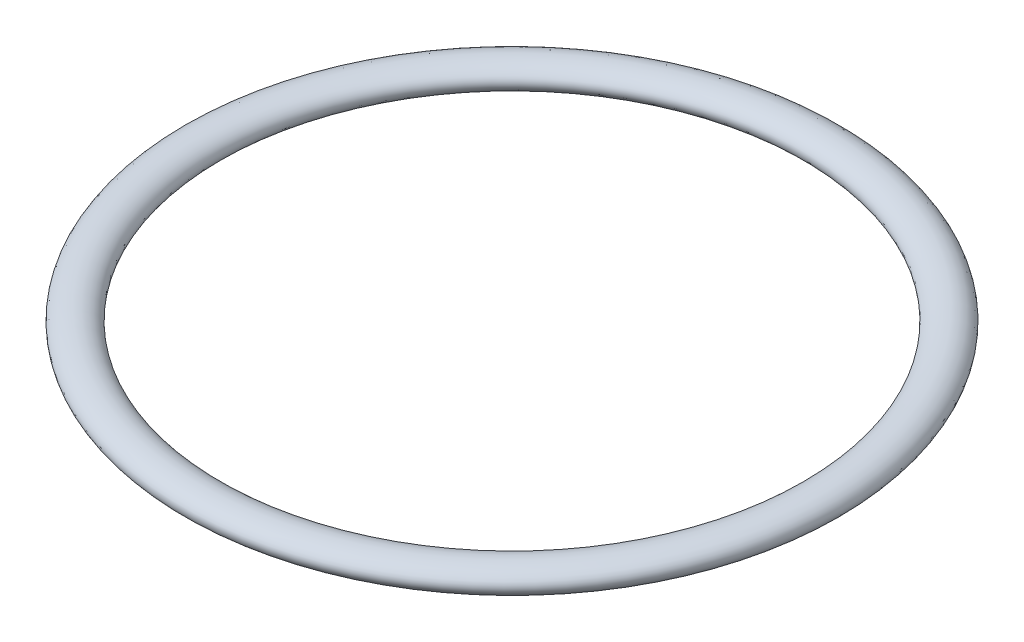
from build123d import *

# Parameters (mm, degrees)
ESQUISSE1_RX = 4.222613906
ESQUISSE1_RY = 2.6


with BuildPart() as part:
    # Esquisse1 → R_volution1 (revolve)
    with BuildSketch(Plane.XY):
        with Locations(Location((-63.5, -2.6), (0, 0, 0))):
            Ellipse(ESQUISSE1_RX, ESQUISSE1_RY)
    revolve(axis=Axis((0, 51.673755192, 0), (0, -1, 0)))


solid = part.part
